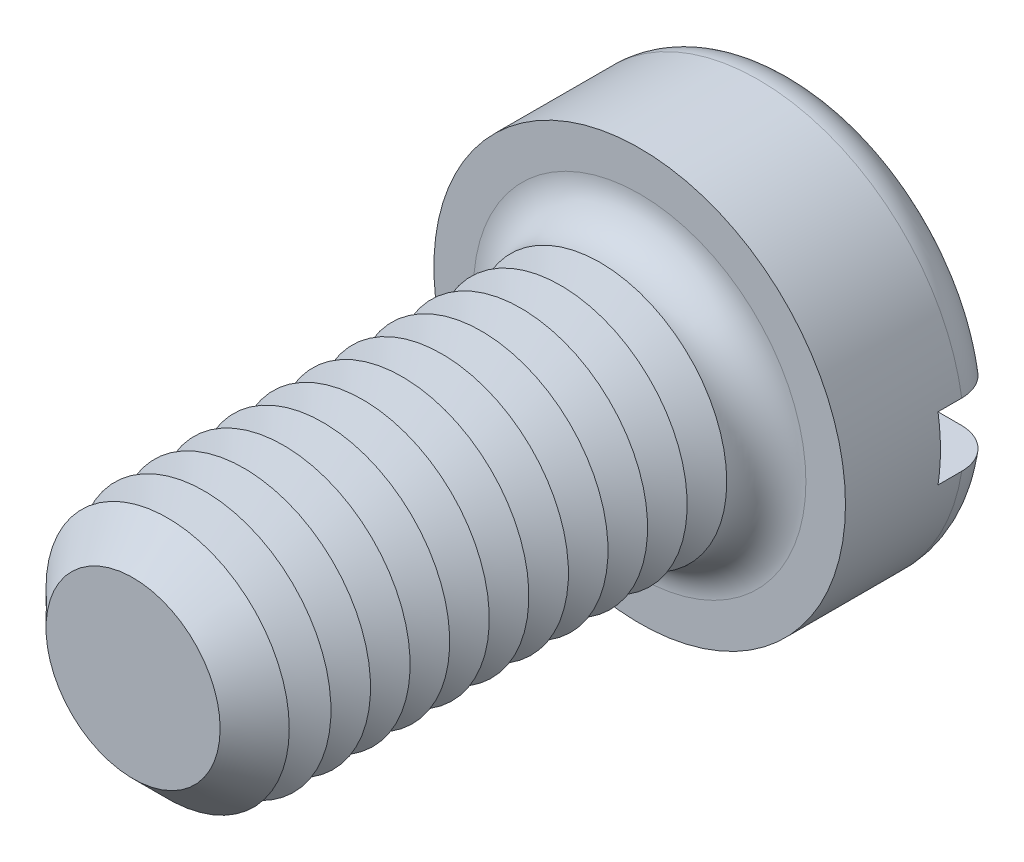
ISO-10303-21;
HEADER;
FILE_DESCRIPTION(('STEP AP214'),'2;1');
FILE_NAME('part.step','',(''),(''),'','','');
FILE_SCHEMA(('AUTOMOTIVE_DESIGN { 1 0 10303 214 1 1 1 1 }'));
ENDSEC;
DATA;
#1=APPLICATION_CONTEXT('core data for automotive mechanical design processes');
#2=APPLICATION_PROTOCOL_DEFINITION('international standard','automotive_design',2000,#1);
#3=PRODUCT_CONTEXT('',#1,'mechanical');
#4=PRODUCT('Part','Part','',(#3));
#5=PRODUCT_RELATED_PRODUCT_CATEGORY('part','',(#4));
#6=PRODUCT_DEFINITION_FORMATION('','',#4);
#7=PRODUCT_DEFINITION_CONTEXT('part definition',#1,'design');
#8=PRODUCT_DEFINITION('design','',#6,#7);
#9=PRODUCT_DEFINITION_SHAPE('','',#8);
#10=(LENGTH_UNIT() NAMED_UNIT(*) SI_UNIT(.MILLI.,.METRE.));
#11=(NAMED_UNIT(*) PLANE_ANGLE_UNIT() SI_UNIT($,.RADIAN.));
#12=(NAMED_UNIT(*) SI_UNIT($,.STERADIAN.) SOLID_ANGLE_UNIT());
#13=UNCERTAINTY_MEASURE_WITH_UNIT(LENGTH_MEASURE(1.E-05),#10,'distance_accuracy_value','');
#14=(GEOMETRIC_REPRESENTATION_CONTEXT(3) GLOBAL_UNCERTAINTY_ASSIGNED_CONTEXT((#13)) GLOBAL_UNIT_ASSIGNED_CONTEXT((#10,
#11,#12)) REPRESENTATION_CONTEXT('',''));
#15=CARTESIAN_POINT('',(0.,0.,0.));
#16=DIRECTION('',(0.,0.,1.));
#17=DIRECTION('',(1.,0.,0.));
#18=AXIS2_PLACEMENT_3D('',#15,#16,#17);
#19=CARTESIAN_POINT('',(0.,0.,-5.));
#20=DIRECTION('',(0.,0.,1.));
#21=DIRECTION('',(1.,0.,0.));
#22=AXIS2_PLACEMENT_3D('',#19,#20,#21);
#23=PLANE('',#22);
#24=CARTESIAN_POINT('',(0.,0.,-5.));
#25=DIRECTION('',(0.,0.,1.));
#26=DIRECTION('',(1.,0.,0.));
#27=AXIS2_PLACEMENT_3D('',#24,#25,#26);
#28=CIRCLE('',#27,5.25);
#29=CARTESIAN_POINT('',(-5.15388203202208,1.,-5.));
#30=VERTEX_POINT('',#29);
#31=CARTESIAN_POINT('',(5.15388203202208,1.,-5.));
#32=VERTEX_POINT('',#31);
#33=EDGE_CURVE('E116',#30,#32,#28,.F.);
#34=ORIENTED_EDGE('',*,*,#33,.T.);
#35=DIRECTION('',(1.,0.,0.));
#36=VECTOR('',#35,1.);
#37=CARTESIAN_POINT('',(-6.5,1.,-5.));
#38=LINE('',#37,#36);
#39=EDGE_CURVE('E111',#30,#32,#38,.T.);
#40=ORIENTED_EDGE('',*,*,#39,.F.);
#41=EDGE_LOOP('',(#34,#40));
#42=FACE_BOUND('',#41,.T.);
#43=ADVANCED_FACE('F39',(#42),#23,.F.);
#44=CARTESIAN_POINT('',(0.,0.,-3.75));
#45=DIRECTION('',(0.,0.,1.));
#46=DIRECTION('',(1.,0.,0.));
#47=AXIS2_PLACEMENT_3D('',#44,#45,#46);
#48=TOROIDAL_SURFACE('',#47,5.25,1.25);
#49=CARTESIAN_POINT('',(-6.04655789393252,1.,-4.63904490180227));
#50=CARTESIAN_POINT('',(-5.99546860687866,1.,-4.68885774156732));
#51=CARTESIAN_POINT('',(-5.94008472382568,1.,-4.73434760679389));
#52=CARTESIAN_POINT('',(-5.8223927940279,1.,-4.81538052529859));
#53=CARTESIAN_POINT('',(-5.7600753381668,1.,-4.85090982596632));
#54=CARTESIAN_POINT('',(-5.63044351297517,1.,-4.91100606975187));
#55=CARTESIAN_POINT('',(-5.56313479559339,1.,-4.93558519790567));
#56=CARTESIAN_POINT('',(-5.42539577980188,1.,-4.97322457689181));
#57=CARTESIAN_POINT('',(-5.35496625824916,1.,-4.98628767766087));
#58=CARTESIAN_POINT('',(-5.21212635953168,1.,-5.00070478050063));
#59=CARTESIAN_POINT('',(-5.13970265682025,1.,-5.00192674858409));
#60=CARTESIAN_POINT('',(-4.99565121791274,1.,-4.99234085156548));
#61=CARTESIAN_POINT('',(-4.92402357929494,1.,-4.98153152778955));
#62=CARTESIAN_POINT('',(-4.78274786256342,1.,-4.94801424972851));
#63=CARTESIAN_POINT('',(-4.71313137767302,1.,-4.92517296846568));
#64=CARTESIAN_POINT('',(-4.57871041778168,1.,-4.86813760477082));
#65=CARTESIAN_POINT('',(-4.51390612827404,1.,-4.83394308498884));
#66=CARTESIAN_POINT('',(-4.39095493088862,1.,-4.75508341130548));
#67=CARTESIAN_POINT('',(-4.33281197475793,1.,-4.7104120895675));
#68=CARTESIAN_POINT('',(-4.22499800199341,1.,-4.61179869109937));
#69=CARTESIAN_POINT('',(-4.17532640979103,1.,-4.55785724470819));
#70=CARTESIAN_POINT('',(-4.08677450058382,1.,-4.4431082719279));
#71=CARTESIAN_POINT('',(-4.0477350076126,1.,-4.38242369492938));
#72=CARTESIAN_POINT('',(-3.98074296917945,1.,-4.25521412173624));
#73=CARTESIAN_POINT('',(-3.95278836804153,1.,-4.18869021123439));
#74=CARTESIAN_POINT('',(-3.90959497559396,1.,-4.0537026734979));
#75=CARTESIAN_POINT('',(-3.89401985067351,1.,-3.98534663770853));
#76=CARTESIAN_POINT('',(-3.8748586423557,1.,-3.84697740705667));
#77=CARTESIAN_POINT('',(-3.87127067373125,1.,-3.7769644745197));
#78=CARTESIAN_POINT('',(-3.8761573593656,1.,-3.63892215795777));
#79=CARTESIAN_POINT('',(-3.88436651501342,1.,-3.57088319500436));
#80=CARTESIAN_POINT('',(-3.91207743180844,1.,-3.43714958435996));
#81=CARTESIAN_POINT('',(-3.93157911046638,1.,-3.37145491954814));
#82=CARTESIAN_POINT('',(-3.98125045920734,1.,-3.24411474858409));
#83=CARTESIAN_POINT('',(-4.01143761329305,1.,-3.18247607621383));
#84=CARTESIAN_POINT('',(-4.08150210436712,1.,-3.064981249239));
#85=CARTESIAN_POINT('',(-4.12138048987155,1.,-3.0091257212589));
#86=CARTESIAN_POINT('',(-4.2106718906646,1.,-2.90336353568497));
#87=CARTESIAN_POINT('',(-4.26028693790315,1.,-2.85362751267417));
#88=CARTESIAN_POINT('',(-4.36696587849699,1.,-2.76291710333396));
#89=CARTESIAN_POINT('',(-4.42403082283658,1.,-2.72194395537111));
#90=CARTESIAN_POINT('',(-4.54567957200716,1.,-2.64877280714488));
#91=CARTESIAN_POINT('',(-4.61042643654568,1.,-2.61684571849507));
#92=CARTESIAN_POINT('',(-4.74430563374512,1.,-2.56412359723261));
#93=CARTESIAN_POINT('',(-4.81343838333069,1.,-2.54332962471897));
#94=CARTESIAN_POINT('',(-4.95527237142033,1.,-2.51320471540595));
#95=CARTESIAN_POINT('',(-5.0280120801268,1.,-2.50405449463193));
#96=CARTESIAN_POINT('',(-5.17399775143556,1.,-2.49810126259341));
#97=CARTESIAN_POINT('',(-5.24724372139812,1.,-2.50129843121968));
#98=CARTESIAN_POINT('',(-5.3921014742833,1.,-2.52000776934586));
#99=CARTESIAN_POINT('',(-5.4637142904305,1.,-2.53551191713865));
#100=CARTESIAN_POINT('',(-5.60326680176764,1.,-2.57846304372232));
#101=CARTESIAN_POINT('',(-5.67120668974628,1.,-2.60590939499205));
#102=CARTESIAN_POINT('',(-5.80064060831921,1.,-2.67164926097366));
#103=CARTESIAN_POINT('',(-5.862199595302,1.,-2.7098148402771));
#104=CARTESIAN_POINT('',(-5.9779079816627,1.,-2.79608690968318));
#105=CARTESIAN_POINT('',(-6.03205795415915,1.,-2.84419263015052));
#106=CARTESIAN_POINT('',(-6.13055119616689,1.,-2.94820522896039));
#107=CARTESIAN_POINT('',(-6.17502887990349,1.,-3.00398483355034));
#108=CARTESIAN_POINT('',(-6.25384180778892,1.,-3.12230113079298));
#109=CARTESIAN_POINT('',(-6.28817779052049,1.,-3.18483733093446));
#110=CARTESIAN_POINT('',(-6.34527986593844,1.,-3.31401726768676));
#111=CARTESIAN_POINT('',(-6.36818984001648,1.,-3.38059742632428));
#112=CARTESIAN_POINT('',(-6.40240470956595,1.,-3.5166725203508));
#113=CARTESIAN_POINT('',(-6.41371067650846,1.,-3.58616718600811));
#114=CARTESIAN_POINT('',(-6.42433240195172,1.,-3.72550026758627));
#115=CARTESIAN_POINT('',(-6.4237441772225,1.,-3.79533138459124));
#116=CARTESIAN_POINT('',(-6.41082814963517,1.,-3.93391789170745));
#117=CARTESIAN_POINT('',(-6.39849757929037,1.,-4.00267302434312));
#118=CARTESIAN_POINT('',(-6.36249191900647,1.,-4.13704597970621));
#119=CARTESIAN_POINT('',(-6.33883072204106,1.,-4.20266753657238));
#120=CARTESIAN_POINT('',(-6.28088769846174,1.,-4.32897165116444));
#121=CARTESIAN_POINT('',(-6.24661890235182,1.,-4.38966015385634));
#122=CARTESIAN_POINT('',(-6.18404039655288,1.,-4.48163773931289));
#123=CARTESIAN_POINT('',(-6.15876600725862,1.,-4.51503333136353));
#124=CARTESIAN_POINT('',(-6.10500607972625,1.,-4.5791298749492));
#125=CARTESIAN_POINT('',(-6.07652056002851,1.,-4.60983084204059));
#126=CARTESIAN_POINT('',(-6.04655789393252,1.,-4.63904490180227));
#127=B_SPLINE_CURVE_WITH_KNOTS('',3,(#49,#50,#51,#52,#53,#54,#55,#56,#57,#58,#59,#60,#61,#62,
#63,#64,#65,#66,#67,#68,#69,#70,#71,#72,#73,#74,#75,#76,#77,#78,#79,#80,#81,#82,#83,#84,#85,#86,
#87,#88,#89,#90,#91,#92,#93,#94,#95,#96,#97,#98,#99,#100,#101,#102,#103,#104,#105,#106,#107,
#108,#109,#110,#111,#112,#113,#114,#115,#116,#117,#118,#119,#120,#121,#122,#123,#124,#125,#126),
.UNSPECIFIED.,.T.,.F.,(4,2,2,2,2,2,2,2,2,2,2,2,2,2,2,2,2,2,2,2,2,2,2,2,2,2,2,2,2,2,2,2,2,2,2,2,
2,2,4),(0.,0.213907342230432,0.428108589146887,0.642070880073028,0.855980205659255,
1.07227200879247,1.28859003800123,1.50735715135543,1.72613269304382,1.94503735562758,
2.16392713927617,2.37933295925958,2.59469881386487,2.80399176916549,3.01325180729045,
3.2178754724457,3.42249764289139,3.62745618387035,3.83243690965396,4.04223444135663,
4.25206160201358,4.46763253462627,4.68322399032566,4.90212226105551,5.12102372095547,
5.33978261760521,5.55853002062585,5.77477015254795,5.99099354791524,6.20398686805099,
6.41696467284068,6.62718821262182,6.83739233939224,7.0459002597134,7.25445733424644,
7.46275934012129,7.67080647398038,7.79625882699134,7.92171045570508),.UNSPECIFIED.);
#128=CARTESIAN_POINT('',(-6.42261628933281,1.,-3.74999999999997));
#129=VERTEX_POINT('',#128);
#130=EDGE_CURVE('E273',#129,#30,#127,.T.);
#131=ORIENTED_EDGE('',*,*,#130,.F.);
#132=CARTESIAN_POINT('',(0.,0.,-3.75));
#133=DIRECTION('',(0.,0.,1.));
#134=DIRECTION('',(1.,0.,0.));
#135=AXIS2_PLACEMENT_3D('',#132,#133,#134);
#136=CIRCLE('',#135,6.5);
#137=CARTESIAN_POINT('',(6.42261628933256,1.,-3.75));
#138=VERTEX_POINT('',#137);
#139=EDGE_CURVE('E125',#138,#129,#136,.T.);
#140=ORIENTED_EDGE('',*,*,#139,.F.);
#141=CARTESIAN_POINT('',(4.06944999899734,1.,-4.4133199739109));
#142=CARTESIAN_POINT('',(4.10828271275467,1.,-4.47354709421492));
#143=CARTESIAN_POINT('',(4.15233880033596,1.,-4.53047894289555));
#144=CARTESIAN_POINT('',(4.24946916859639,1.,-4.63614530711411));
#145=CARTESIAN_POINT('',(4.3025574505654,1.,-4.68486685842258));
#146=CARTESIAN_POINT('',(4.41603250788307,1.,-4.77271114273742));
#147=CARTESIAN_POINT('',(4.47640839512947,1.,-4.8118479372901));
#148=CARTESIAN_POINT('',(4.60277035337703,1.,-4.87959878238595));
#149=CARTESIAN_POINT('',(4.66875480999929,1.,-4.90821584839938));
#150=CARTESIAN_POINT('',(4.80558589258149,1.,-4.95456537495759));
#151=CARTESIAN_POINT('',(4.87649196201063,1.,-4.97212253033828));
#152=CARTESIAN_POINT('',(5.02024710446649,1.,-4.99514979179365));
#153=CARTESIAN_POINT('',(5.09309636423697,1.,-5.00061873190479));
#154=CARTESIAN_POINT('',(5.23902872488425,1.,-4.99926689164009));
#155=CARTESIAN_POINT('',(5.31211131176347,1.,-4.99238812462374));
#156=CARTESIAN_POINT('',(5.45605806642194,1.,-4.96635140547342));
#157=CARTESIAN_POINT('',(5.52692231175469,1.,-4.94719388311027));
#158=CARTESIAN_POINT('',(5.66376170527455,1.,-4.89728421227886));
#159=CARTESIAN_POINT('',(5.72977335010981,1.,-4.86663219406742));
#160=CARTESIAN_POINT('',(5.85560715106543,1.,-4.79452334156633));
#161=CARTESIAN_POINT('',(5.91542977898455,1.,-4.7530673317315));
#162=CARTESIAN_POINT('',(6.02626022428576,1.,-4.66116821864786));
#163=CARTESIAN_POINT('',(6.07738307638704,1.,-4.6108638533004));
#164=CARTESIAN_POINT('',(6.17030947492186,1.,-4.50227823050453));
#165=CARTESIAN_POINT('',(6.2121137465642,1.,-4.44399759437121));
#166=CARTESIAN_POINT('',(6.28460268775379,1.,-4.32200305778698));
#167=CARTESIAN_POINT('',(6.31543589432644,1.,-4.2583773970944));
#168=CARTESIAN_POINT('',(6.36586009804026,1.,-4.12681721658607));
#169=CARTESIAN_POINT('',(6.38545178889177,1.,-4.0588829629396));
#170=CARTESIAN_POINT('',(6.41265760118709,1.,-3.92136007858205));
#171=CARTESIAN_POINT('',(6.42038873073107,1.,-3.85179457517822));
#172=CARTESIAN_POINT('',(6.42401070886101,1.,-3.7123569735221));
#173=CARTESIAN_POINT('',(6.41990193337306,1.,-3.64248488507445));
#174=CARTESIAN_POINT('',(6.40000894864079,1.,-3.50470871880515));
#175=CARTESIAN_POINT('',(6.38427119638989,1.,-3.43679792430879));
#176=CARTESIAN_POINT('',(6.34164491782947,1.,-3.30457296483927));
#177=CARTESIAN_POINT('',(6.31475638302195,1.,-3.24025880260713));
#178=CARTESIAN_POINT('',(6.2505455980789,1.,-3.11686791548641));
#179=CARTESIAN_POINT('',(6.21319759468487,1.,-3.05780459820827));
#180=CARTESIAN_POINT('',(6.12919411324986,1.,-2.94671919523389));
#181=CARTESIAN_POINT('',(6.08253833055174,1.,-2.89469734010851));
#182=CARTESIAN_POINT('',(5.98083387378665,1.,-2.79868150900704));
#183=CARTESIAN_POINT('',(5.92571704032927,1.,-2.75475975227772));
#184=CARTESIAN_POINT('',(5.80897194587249,1.,-2.67665277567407));
#185=CARTESIAN_POINT('',(5.74734329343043,1.,-2.64246814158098));
#186=CARTESIAN_POINT('',(5.6184644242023,1.,-2.58431810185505));
#187=CARTESIAN_POINT('',(5.55115102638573,1.,-2.56049275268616));
#188=CARTESIAN_POINT('',(5.41351272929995,1.,-2.52429868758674));
#189=CARTESIAN_POINT('',(5.34318759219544,1.,-2.51193087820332));
#190=CARTESIAN_POINT('',(5.20041507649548,1.,-2.49882112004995));
#191=CARTESIAN_POINT('',(5.12795169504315,1.,-2.49825332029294));
#192=CARTESIAN_POINT('',(4.98393373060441,1.,-2.50914771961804));
#193=CARTESIAN_POINT('',(4.91237921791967,1.,-2.52061084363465));
#194=CARTESIAN_POINT('',(4.77137358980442,1.,-2.55542281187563));
#195=CARTESIAN_POINT('',(4.70195472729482,1.,-2.57890245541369));
#196=CARTESIAN_POINT('',(4.56803538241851,1.,-2.63717701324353));
#197=CARTESIAN_POINT('',(4.50353509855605,1.,-2.67197238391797));
#198=CARTESIAN_POINT('',(4.38131858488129,1.,-2.7519648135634));
#199=CARTESIAN_POINT('',(4.32360365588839,1.,-2.79716386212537));
#200=CARTESIAN_POINT('',(4.21673400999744,1.,-2.89675634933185));
#201=CARTESIAN_POINT('',(4.16757871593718,1.,-2.95114916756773));
#202=CARTESIAN_POINT('',(4.08014713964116,1.,-3.06667703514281));
#203=CARTESIAN_POINT('',(4.04170608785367,1.,-3.12768727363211));
#204=CARTESIAN_POINT('',(3.97596192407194,1.,-3.25543782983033));
#205=CARTESIAN_POINT('',(3.94865624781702,1.,-3.32217682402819));
#206=CARTESIAN_POINT('',(3.9067737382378,1.,-3.45745603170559));
#207=CARTESIAN_POINT('',(3.89185707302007,1.,-3.52589108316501));
#208=CARTESIAN_POINT('',(3.87400755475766,1.,-3.66432360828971));
#209=CARTESIAN_POINT('',(3.87107601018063,1.,-3.73432125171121));
#210=CARTESIAN_POINT('',(3.8772387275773,1.,-3.87228267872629));
#211=CARTESIAN_POINT('',(3.88607933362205,1.,-3.94025811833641));
#212=CARTESIAN_POINT('',(3.91502769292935,1.,-4.07370133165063));
#213=CARTESIAN_POINT('',(3.93512131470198,1.,-4.1391721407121));
#214=CARTESIAN_POINT('',(3.9752037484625,1.,-4.23926719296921));
#215=CARTESIAN_POINT('',(3.99171171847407,1.,-4.27532618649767));
#216=CARTESIAN_POINT('',(4.02809737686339,1.,-4.34569933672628));
#217=CARTESIAN_POINT('',(4.04797497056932,1.,-4.3800135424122));
#218=CARTESIAN_POINT('',(4.06944999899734,1.,-4.4133199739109));
#219=B_SPLINE_CURVE_WITH_KNOTS('',3,(#141,#142,#143,#144,#145,#146,#147,#148,#149,#150,#151,
#152,#153,#154,#155,#156,#157,#158,#159,#160,#161,#162,#163,#164,#165,#166,#167,#168,#169,#170,
#171,#172,#173,#174,#175,#176,#177,#178,#179,#180,#181,#182,#183,#184,#185,#186,#187,#188,#189,
#190,#191,#192,#193,#194,#195,#196,#197,#198,#199,#200,#201,#202,#203,#204,#205,#206,#207,#208,
#209,#210,#211,#212,#213,#214,#215,#216,#217,#218),.UNSPECIFIED.,.T.,.F.,(4,2,2,2,2,2,2,2,2,2,2,
2,2,2,2,2,2,2,2,2,2,2,2,2,2,2,2,2,2,2,2,2,2,2,2,2,2,2,4),(0.,0.214833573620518,
0.430003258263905,0.644855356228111,0.859645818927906,1.0777603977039,1.29589601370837,
1.51505870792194,1.73421373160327,1.95150241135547,2.16877451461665,2.38290237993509,
2.59701357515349,2.8081044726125,3.01918234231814,3.22816416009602,3.43713934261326,
3.64528416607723,3.85342914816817,4.06209119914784,4.27076008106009,4.48120788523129,
4.69166834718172,4.90489186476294,5.11813225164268,5.33451752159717,5.55091942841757,
5.76972860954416,5.98854661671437,6.20740650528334,6.42625163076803,6.64151774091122,
6.85673425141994,7.0658317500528,7.27495207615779,7.47963858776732,7.68406862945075,
7.80287790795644,7.92168384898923),.UNSPECIFIED.);
#220=EDGE_CURVE('E275',#32,#138,#219,.T.);
#221=ORIENTED_EDGE('',*,*,#220,.F.);
#222=ORIENTED_EDGE('',*,*,#33,.F.);
#223=EDGE_LOOP('',(#131,#140,#221,#222));
#224=FACE_BOUND('',#223,.T.);
#225=ADVANCED_FACE('F257',(#224),#48,.T.);
#226=CARTESIAN_POINT('',(0.,0.,-5.));
#227=DIRECTION('',(0.,0.,1.));
#228=DIRECTION('',(1.,0.,0.));
#229=AXIS2_PLACEMENT_3D('',#226,#227,#228);
#230=CYLINDRICAL_SURFACE('',#229,6.5);
#231=DIRECTION('',(0.,0.,1.));
#232=VECTOR('',#231,1.);
#233=CARTESIAN_POINT('',(6.42261628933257,1.,-5.));
#234=LINE('',#233,#232);
#235=CARTESIAN_POINT('',(6.42261628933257,1.,-3.));
#236=VERTEX_POINT('',#235);
#237=EDGE_CURVE('E290',#138,#236,#234,.T.);
#238=ORIENTED_EDGE('',*,*,#237,.F.);
#239=ORIENTED_EDGE('',*,*,#139,.T.);
#240=DIRECTION('',(0.,0.,1.));
#241=VECTOR('',#240,1.);
#242=CARTESIAN_POINT('',(-6.42261628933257,1.,-5.));
#243=LINE('',#242,#241);
#244=CARTESIAN_POINT('',(-6.42261628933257,1.,-3.));
#245=VERTEX_POINT('',#244);
#246=EDGE_CURVE('E63',#245,#129,#243,.F.);
#247=ORIENTED_EDGE('',*,*,#246,.F.);
#248=CARTESIAN_POINT('',(0.,0.,-3.));
#249=DIRECTION('',(0.,0.,-1.));
#250=DIRECTION('',(-1.,0.,0.));
#251=AXIS2_PLACEMENT_3D('',#248,#249,#250);
#252=CIRCLE('',#251,6.5);
#253=CARTESIAN_POINT('',(-6.42261628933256,-0.999999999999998,-3.));
#254=VERTEX_POINT('',#253);
#255=EDGE_CURVE('E43',#245,#254,#252,.F.);
#256=ORIENTED_EDGE('',*,*,#255,.T.);
#257=DIRECTION('',(0.,0.,1.));
#258=VECTOR('',#257,1.);
#259=CARTESIAN_POINT('',(-6.42261628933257,-0.999999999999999,-5.));
#260=LINE('',#259,#258);
#261=CARTESIAN_POINT('',(-6.42261628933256,-0.999999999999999,-3.75));
#262=VERTEX_POINT('',#261);
#263=EDGE_CURVE('E287',#262,#254,#260,.T.);
#264=ORIENTED_EDGE('',*,*,#263,.F.);
#265=CARTESIAN_POINT('',(6.42261628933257,-1.,-3.75));
#266=VERTEX_POINT('',#265);
#267=EDGE_CURVE('E127',#262,#266,#136,.T.);
#268=ORIENTED_EDGE('',*,*,#267,.T.);
#269=DIRECTION('',(0.,0.,1.));
#270=VECTOR('',#269,1.);
#271=CARTESIAN_POINT('',(6.42261628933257,-1.,-5.));
#272=LINE('',#271,#270);
#273=CARTESIAN_POINT('',(6.42261628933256,-1.,-3.));
#274=VERTEX_POINT('',#273);
#275=EDGE_CURVE('E55',#274,#266,#272,.F.);
#276=ORIENTED_EDGE('',*,*,#275,.F.);
#277=EDGE_CURVE('E11',#274,#236,#252,.F.);
#278=ORIENTED_EDGE('',*,*,#277,.T.);
#279=EDGE_LOOP('',(#238,#239,#247,#256,#264,#268,#276,#278));
#280=FACE_BOUND('',#279,.T.);
#281=CARTESIAN_POINT('',(0.,0.,0.));
#282=DIRECTION('',(0.,0.,1.));
#283=DIRECTION('',(1.,0.,0.));
#284=AXIS2_PLACEMENT_3D('',#281,#282,#283);
#285=CIRCLE('',#284,6.5);
#286=CARTESIAN_POINT('',(6.5,0.,0.));
#287=VERTEX_POINT('',#286);
#288=EDGE_CURVE('E293',#287,#287,#285,.T.);
#289=ORIENTED_EDGE('',*,*,#288,.F.);
#290=EDGE_LOOP('',(#289));
#291=FACE_BOUND('',#290,.T.);
#292=ADVANCED_FACE('F253',(#280,#291),#230,.T.);
#293=CARTESIAN_POINT('',(5.15388203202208,-1.,-5.));
#294=VERTEX_POINT('',#293);
#295=CARTESIAN_POINT('',(-5.15388203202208,-0.999999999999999,-5.));
#296=VERTEX_POINT('',#295);
#297=EDGE_CURVE('E109',#294,#296,#28,.F.);
#298=ORIENTED_EDGE('',*,*,#297,.T.);
#299=DIRECTION('',(-1.,0.,0.));
#300=VECTOR('',#299,1.);
#301=CARTESIAN_POINT('',(-6.5,-0.999999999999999,-5.));
#302=LINE('',#301,#300);
#303=EDGE_CURVE('E96',#294,#296,#302,.T.);
#304=ORIENTED_EDGE('',*,*,#303,.F.);
#305=EDGE_LOOP('',(#298,#304));
#306=FACE_BOUND('',#305,.T.);
#307=ADVANCED_FACE('F108',(#306),#23,.F.);
#308=CARTESIAN_POINT('',(0.,0.,0.));
#309=DIRECTION('',(0.,0.,1.));
#310=DIRECTION('',(1.,0.,0.));
#311=AXIS2_PLACEMENT_3D('',#308,#309,#310);
#312=PLANE('',#311);
#313=CARTESIAN_POINT('',(0.,0.,0.));
#314=DIRECTION('',(0.,0.,1.));
#315=DIRECTION('',(1.,0.,0.));
#316=AXIS2_PLACEMENT_3D('',#313,#314,#315);
#317=CIRCLE('',#316,5.25);
#318=CARTESIAN_POINT('',(5.25,0.,0.));
#319=VERTEX_POINT('',#318);
#320=EDGE_CURVE('E115',#319,#319,#317,.F.);
#321=ORIENTED_EDGE('',*,*,#320,.T.);
#322=EDGE_LOOP('',(#321));
#323=FACE_BOUND('',#322,.T.);
#324=ORIENTED_EDGE('',*,*,#288,.T.);
#325=EDGE_LOOP('',(#324));
#326=FACE_BOUND('',#325,.T.);
#327=ADVANCED_FACE('F252',(#323,#326),#312,.T.);
#328=CARTESIAN_POINT('',(-6.04655789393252,-0.999999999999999,-4.63904490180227));
#329=CARTESIAN_POINT('',(-6.0966604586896,-0.999999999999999,-4.59018532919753));
#330=CARTESIAN_POINT('',(-6.14270501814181,-0.999999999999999,-4.53709744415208));
#331=CARTESIAN_POINT('',(-6.22528519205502,-0.999999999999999,-4.42391631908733));
#332=CARTESIAN_POINT('',(-6.26181074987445,-0.999999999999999,-4.36381576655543));
#333=CARTESIAN_POINT('',(-6.32422109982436,-0.999999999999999,-4.23831836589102));
#334=CARTESIAN_POINT('',(-6.35010658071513,-0.999999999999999,-4.17292186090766));
#335=CARTESIAN_POINT('',(-6.39044668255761,-0.999999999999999,-4.03870925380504));
#336=CARTESIAN_POINT('',(-6.40490396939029,-0.999999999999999,-3.96989395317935));
#337=CARTESIAN_POINT('',(-6.42190814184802,-0.999999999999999,-3.83122595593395));
#338=CARTESIAN_POINT('',(-6.4245257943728,-0.999999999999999,-3.76138193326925));
#339=CARTESIAN_POINT('',(-6.41796432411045,-0.999999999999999,-3.62224935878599));
#340=CARTESIAN_POINT('',(-6.40878509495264,-0.999999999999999,-3.55296081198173));
#341=CARTESIAN_POINT('',(-6.37894560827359,-0.999999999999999,-3.41709241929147));
#342=CARTESIAN_POINT('',(-6.35831520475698,-0.999999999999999,-3.35050601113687));
#343=CARTESIAN_POINT('',(-6.30620980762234,-0.999999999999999,-3.22172312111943));
#344=CARTESIAN_POINT('',(-6.2747347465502,-0.999999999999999,-3.15952666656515));
#345=CARTESIAN_POINT('',(-6.20172710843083,-0.999999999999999,-3.04101762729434));
#346=CARTESIAN_POINT('',(-6.16015622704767,-0.999999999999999,-2.98472864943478));
#347=CARTESIAN_POINT('',(-6.06823774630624,-0.999999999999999,-2.87984578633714));
#348=CARTESIAN_POINT('',(-6.01788981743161,-0.999999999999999,-2.83125219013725));
#349=CARTESIAN_POINT('',(-5.90933830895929,-0.999999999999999,-2.74262118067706));
#350=CARTESIAN_POINT('',(-5.85106338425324,-0.999999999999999,-2.70267117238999));
#351=CARTESIAN_POINT('',(-5.72870702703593,-0.999999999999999,-2.63296796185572));
#352=CARTESIAN_POINT('',(-5.66462521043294,-0.999999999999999,-2.6032154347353));
#353=CARTESIAN_POINT('',(-5.53153273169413,-0.999999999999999,-2.55430842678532));
#354=CARTESIAN_POINT('',(-5.46246626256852,-0.999999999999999,-2.53530583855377));
#355=CARTESIAN_POINT('',(-5.32214267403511,-0.999999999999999,-2.5089831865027));
#356=CARTESIAN_POINT('',(-5.25088537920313,-0.999999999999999,-2.50166406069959));
#357=CARTESIAN_POINT('',(-5.10710123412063,-0.999999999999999,-2.49882202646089));
#358=CARTESIAN_POINT('',(-5.03457095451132,-0.999999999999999,-2.50347166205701));
#359=CARTESIAN_POINT('',(-4.8912897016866,-0.999999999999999,-2.52476029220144));
#360=CARTESIAN_POINT('',(-4.82053886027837,-0.999999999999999,-2.54140017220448));
#361=CARTESIAN_POINT('',(-4.68213257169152,-0.999999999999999,-2.58641614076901));
#362=CARTESIAN_POINT('',(-4.61451256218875,-0.999999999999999,-2.61490131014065));
#363=CARTESIAN_POINT('',(-4.48502801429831,-0.999999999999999,-2.68285095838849));
#364=CARTESIAN_POINT('',(-4.42316359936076,-0.999999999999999,-2.72231567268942));
#365=CARTESIAN_POINT('',(-4.30720694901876,-0.999999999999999,-2.81103994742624));
#366=CARTESIAN_POINT('',(-4.25309118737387,-0.999999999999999,-2.86026872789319));
#367=CARTESIAN_POINT('',(-4.15409408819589,-0.999999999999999,-2.9672764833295));
#368=CARTESIAN_POINT('',(-4.10921182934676,-0.999999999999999,-3.02505460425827));
#369=CARTESIAN_POINT('',(-4.03096584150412,-0.999999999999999,-3.14632492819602));
#370=CARTESIAN_POINT('',(-3.99739097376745,-0.999999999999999,-3.2096807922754));
#371=CARTESIAN_POINT('',(-3.94171839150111,-0.999999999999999,-3.34124912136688));
#372=CARTESIAN_POINT('',(-3.91961840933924,-0.999999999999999,-3.40946062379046));
#373=CARTESIAN_POINT('',(-3.88816636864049,-0.999999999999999,-3.54669256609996));
#374=CARTESIAN_POINT('',(-3.87846562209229,-0.999999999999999,-3.61563318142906));
#375=CARTESIAN_POINT('',(-3.87100568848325,-0.999999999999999,-3.75415397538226));
#376=CARTESIAN_POINT('',(-3.87324501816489,-0.999999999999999,-3.82373407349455));
#377=CARTESIAN_POINT('',(-3.88943589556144,-0.999999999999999,-3.96027701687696));
#378=CARTESIAN_POINT('',(-3.90318225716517,-0.999999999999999,-4.0272643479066));
#379=CARTESIAN_POINT('',(-3.94163954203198,-0.999999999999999,-4.1580093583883));
#380=CARTESIAN_POINT('',(-3.96635075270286,-0.999999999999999,-4.22176695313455));
#381=CARTESIAN_POINT('',(-4.026160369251,-0.999999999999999,-4.34483320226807));
#382=CARTESIAN_POINT('',(-4.06134035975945,-0.999999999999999,-4.40410214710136));
#383=CARTESIAN_POINT('',(-4.14090865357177,-0.999999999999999,-4.51609417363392));
#384=CARTESIAN_POINT('',(-4.18529811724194,-0.999999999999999,-4.56881642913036));
#385=CARTESIAN_POINT('',(-4.2832649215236,-0.999999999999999,-4.66770177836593));
#386=CARTESIAN_POINT('',(-4.33705327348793,-0.999999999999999,-4.71365579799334));
#387=CARTESIAN_POINT('',(-4.45141776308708,-0.999999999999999,-4.79615385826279));
#388=CARTESIAN_POINT('',(-4.51199483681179,-0.999999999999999,-4.83269659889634));
#389=CARTESIAN_POINT('',(-4.63989216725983,-0.999999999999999,-4.89626962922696));
#390=CARTESIAN_POINT('',(-4.70734508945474,-0.999999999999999,-4.92303326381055));
#391=CARTESIAN_POINT('',(-4.84575497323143,-0.999999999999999,-4.96500199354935));
#392=CARTESIAN_POINT('',(-4.91671207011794,-0.999999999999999,-4.98020664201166));
#393=CARTESIAN_POINT('',(-5.06097761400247,-0.999999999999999,-4.9987306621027));
#394=CARTESIAN_POINT('',(-5.13430353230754,-0.999999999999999,-5.00191441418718));
#395=CARTESIAN_POINT('',(-5.28046546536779,-0.999999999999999,-4.99587686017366));
#396=CARTESIAN_POINT('',(-5.35330135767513,-0.999999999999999,-4.98665256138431));
#397=CARTESIAN_POINT('',(-5.49610354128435,-0.999999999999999,-4.95604184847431));
#398=CARTESIAN_POINT('',(-5.56607890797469,-0.999999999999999,-4.93469772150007));
#399=CARTESIAN_POINT('',(-5.70131538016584,-0.999999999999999,-4.88041956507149));
#400=CARTESIAN_POINT('',(-5.76658233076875,-0.999999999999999,-4.84750021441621));
#401=CARTESIAN_POINT('',(-5.86782577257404,-0.999999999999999,-4.78498748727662));
#402=CARTESIAN_POINT('',(-5.90579749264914,-0.999999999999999,-4.75856648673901));
#403=CARTESIAN_POINT('',(-5.97862186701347,-0.999999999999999,-4.70172646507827));
#404=CARTESIAN_POINT('',(-6.0134745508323,-0.999999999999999,-4.6713074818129));
#405=CARTESIAN_POINT('',(-6.04655789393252,-0.999999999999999,-4.63904490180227));
#406=B_SPLINE_CURVE_WITH_KNOTS('',3,(#328,#329,#330,#331,#332,#333,#334,#335,#336,#337,#338,
#339,#340,#341,#342,#343,#344,#345,#346,#347,#348,#349,#350,#351,#352,#353,#354,#355,#356,#357,
#358,#359,#360,#361,#362,#363,#364,#365,#366,#367,#368,#369,#370,#371,#372,#373,#374,#375,#376,
#377,#378,#379,#380,#381,#382,#383,#384,#385,#386,#387,#388,#389,#390,#391,#392,#393,#394,#395,
#396,#397,#398,#399,#400,#401,#402,#403,#404,#405),.UNSPECIFIED.,.T.,.F.,(4,2,2,2,2,2,2,2,2,2,2,
2,2,2,2,2,2,2,2,2,2,2,2,2,2,2,2,2,2,2,2,2,2,2,2,2,2,2,4),(0.,0.209780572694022,
0.419781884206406,0.629769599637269,0.839708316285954,1.04839053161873,1.2570746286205,
1.46521720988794,1.67336108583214,1.88230736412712,2.09126148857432,2.30223890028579,
2.51323027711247,2.72713284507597,2.94105258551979,3.15807345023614,3.37511034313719,
3.59419176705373,3.81327788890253,4.03168404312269,4.25006839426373,4.46411376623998,
4.67811682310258,4.88595885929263,5.09377507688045,5.29796268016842,5.50215563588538,
5.70798353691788,5.91383738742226,6.12510741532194,6.33640661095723,6.55309998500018,
6.76980173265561,6.98894112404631,7.20813337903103,7.42656551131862,7.64472163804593,
7.78324365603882,7.92176436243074),.UNSPECIFIED.);
#407=EDGE_CURVE('E103',#296,#262,#406,.T.);
#408=ORIENTED_EDGE('',*,*,#407,.F.);
#409=ORIENTED_EDGE('',*,*,#297,.F.);
#410=CARTESIAN_POINT('',(4.06944999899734,-1.,-4.4133199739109));
#411=CARTESIAN_POINT('',(4.03213207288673,-1.,-4.3554312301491));
#412=CARTESIAN_POINT('',(3.9995849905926,-1.,-4.29441722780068));
#413=CARTESIAN_POINT('',(3.94511822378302,-1.,-4.16776604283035));
#414=CARTESIAN_POINT('',(3.92320762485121,-1.,-4.10212496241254));
#415=CARTESIAN_POINT('',(3.89078811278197,-1.,-3.96804412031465));
#416=CARTESIAN_POINT('',(3.88028409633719,-1.,-3.89960316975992));
#417=CARTESIAN_POINT('',(3.87107895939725,-1.,-3.76194650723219));
#418=CARTESIAN_POINT('',(3.87237511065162,-1.,-3.69273097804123));
#419=CARTESIAN_POINT('',(3.88662927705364,-1.,-3.55634460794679));
#420=CARTESIAN_POINT('',(3.89944923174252,-1.,-3.48915926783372));
#421=CARTESIAN_POINT('',(3.93611188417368,-1.,-3.35786953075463));
#422=CARTESIAN_POINT('',(3.95995518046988,-1.,-3.29376530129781));
#423=CARTESIAN_POINT('',(4.0180748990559,-1.,-3.16993562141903));
#424=CARTESIAN_POINT('',(4.05242297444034,-1.,-3.11024385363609));
#425=CARTESIAN_POINT('',(4.13041121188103,-1.,-2.9972793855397));
#426=CARTESIAN_POINT('',(4.17405248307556,-1.,-2.94400745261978));
#427=CARTESIAN_POINT('',(4.27058636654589,-1.,-2.8439150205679));
#428=CARTESIAN_POINT('',(4.32368948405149,-1.,-2.79729757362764));
#429=CARTESIAN_POINT('',(4.43679856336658,-1.,-2.71336600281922));
#430=CARTESIAN_POINT('',(4.49680546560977,-1.,-2.67605314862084));
#431=CARTESIAN_POINT('',(4.62370121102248,-1.,-2.61081752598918));
#432=CARTESIAN_POINT('',(4.69072799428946,-1.,-2.58316284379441));
#433=CARTESIAN_POINT('',(4.82843981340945,-1.,-2.5393441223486));
#434=CARTESIAN_POINT('',(4.899125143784,-1.,-2.52318100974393));
#435=CARTESIAN_POINT('',(5.04306377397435,-1.,-2.50267755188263));
#436=CARTESIAN_POINT('',(5.11633773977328,-1.,-2.49848181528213));
#437=CARTESIAN_POINT('',(5.26254809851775,-1.,-2.50249357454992));
#438=CARTESIAN_POINT('',(5.33548449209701,-1.,-2.51070104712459));
#439=CARTESIAN_POINT('',(5.4786703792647,-1.,-2.53930888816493));
#440=CARTESIAN_POINT('',(5.54892819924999,-1.,-2.5596675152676));
#441=CARTESIAN_POINT('',(5.68495799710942,-1.,-2.61204238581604));
#442=CARTESIAN_POINT('',(5.75073024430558,-1.,-2.64405792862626));
#443=CARTESIAN_POINT('',(5.8750178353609,-1.,-2.7184150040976));
#444=CARTESIAN_POINT('',(5.93361487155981,-1.,-2.76061995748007));
#445=CARTESIAN_POINT('',(6.04275377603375,-1.,-2.85440601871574));
#446=CARTESIAN_POINT('',(6.09329629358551,-1.,-2.90598637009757));
#447=CARTESIAN_POINT('',(6.18409572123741,-1.,-3.01622977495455));
#448=CARTESIAN_POINT('',(6.2244945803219,-1.,-3.07477592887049));
#449=CARTESIAN_POINT('',(6.29474798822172,-1.,-3.19788594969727));
#450=CARTESIAN_POINT('',(6.3246032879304,-1.,-3.26244938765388));
#451=CARTESIAN_POINT('',(6.37256001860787,-1.,-3.39491634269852));
#452=CARTESIAN_POINT('',(6.39079949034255,-1.,-3.46276990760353));
#453=CARTESIAN_POINT('',(6.41554133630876,-1.,-3.60058363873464));
#454=CARTESIAN_POINT('',(6.42204424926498,-1.,-3.67054370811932));
#455=CARTESIAN_POINT('',(6.42311237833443,-1.,-3.81007982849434));
#456=CARTESIAN_POINT('',(6.41775799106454,-1.,-3.879655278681));
#457=CARTESIAN_POINT('',(6.39543799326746,-1.,-4.01691664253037));
#458=CARTESIAN_POINT('',(6.3784725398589,-1.,-4.08460258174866));
#459=CARTESIAN_POINT('',(6.33344768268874,-1.,-4.21614537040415));
#460=CARTESIAN_POINT('',(6.30539273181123,-1.,-4.28000374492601));
#461=CARTESIAN_POINT('',(6.23902076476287,-1.,-4.40214140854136));
#462=CARTESIAN_POINT('',(6.20070356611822,-1.,-4.46042059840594));
#463=CARTESIAN_POINT('',(6.11467174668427,-1.,-4.5701315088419));
#464=CARTESIAN_POINT('',(6.06690270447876,-1.,-4.62152053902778));
#465=CARTESIAN_POINT('',(5.96350111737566,-1.,-4.715657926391));
#466=CARTESIAN_POINT('',(5.90786817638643,-1.,-4.75840584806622));
#467=CARTESIAN_POINT('',(5.78965380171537,-1.,-4.8345781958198));
#468=CARTESIAN_POINT('',(5.72700078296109,-1.,-4.86789149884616));
#469=CARTESIAN_POINT('',(5.59704977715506,-1.,-4.92369754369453));
#470=CARTESIAN_POINT('',(5.52975144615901,-1.,-4.94618948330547));
#471=CARTESIAN_POINT('',(5.39137621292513,-1.,-4.98006173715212));
#472=CARTESIAN_POINT('',(5.32025859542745,-1.,-4.99127571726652));
#473=CARTESIAN_POINT('',(5.17715081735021,-1.,-5.00177798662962));
#474=CARTESIAN_POINT('',(5.10516061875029,-1.,-5.00106575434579));
#475=CARTESIAN_POINT('',(4.96131924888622,-1.,-4.98769775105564));
#476=CARTESIAN_POINT('',(4.88948297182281,-1.,-4.97488146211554));
#477=CARTESIAN_POINT('',(4.74893184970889,-1.,-4.93744335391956));
#478=CARTESIAN_POINT('',(4.68021795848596,-1.,-4.91281795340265));
#479=CARTESIAN_POINT('',(4.54744428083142,-1.,-4.8522329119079));
#480=CARTESIAN_POINT('',(4.48341761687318,-1.,-4.81620070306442));
#481=CARTESIAN_POINT('',(4.36244497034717,-1.,-4.73383277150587));
#482=CARTESIAN_POINT('',(4.30549069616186,-1.,-4.68750929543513));
#483=CARTESIAN_POINT('',(4.21823158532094,-1.,-4.60311228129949));
#484=CARTESIAN_POINT('',(4.18544074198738,-1.,-4.56757118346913));
#485=CARTESIAN_POINT('',(4.12413461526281,-1.,-4.49297229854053));
#486=CARTESIAN_POINT('',(4.09561926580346,-1.,-4.45391456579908));
#487=CARTESIAN_POINT('',(4.06944999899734,-1.,-4.4133199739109));
#488=B_SPLINE_CURVE_WITH_KNOTS('',3,(#410,#411,#412,#413,#414,#415,#416,#417,#418,#419,#420,
#421,#422,#423,#424,#425,#426,#427,#428,#429,#430,#431,#432,#433,#434,#435,#436,#437,#438,#439,
#440,#441,#442,#443,#444,#445,#446,#447,#448,#449,#450,#451,#452,#453,#454,#455,#456,#457,#458,
#459,#460,#461,#462,#463,#464,#465,#466,#467,#468,#469,#470,#471,#472,#473,#474,#475,#476,#477,
#478,#479,#480,#481,#482,#483,#484,#485,#486,#487),.UNSPECIFIED.,.T.,.F.,(4,2,2,2,2,2,2,2,2,2,2,
2,2,2,2,2,2,2,2,2,2,2,2,2,2,2,2,2,2,2,2,2,2,2,2,2,2,2,4),(0.,0.206453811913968,0.4130836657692,
0.619802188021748,0.826472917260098,1.03070015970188,1.23493849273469,1.44060223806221,
1.64629054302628,1.85731119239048,2.06836062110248,2.28487349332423,2.5014038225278,
2.72053974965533,2.9396752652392,3.15806230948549,3.37643622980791,3.59203140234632,
3.80760918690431,4.01997696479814,4.23232961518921,4.44210913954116,4.65187903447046,
4.86023097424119,5.06858009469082,5.27684563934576,5.48511488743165,5.69462015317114,
5.90413597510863,6.11602561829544,6.32793096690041,6.54291770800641,6.75791385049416,
6.97580180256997,7.19375587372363,7.41312537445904,7.63223520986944,7.77701357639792,
7.92178970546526),.UNSPECIFIED.);
#489=EDGE_CURVE('E92',#266,#294,#488,.T.);
#490=ORIENTED_EDGE('',*,*,#489,.F.);
#491=ORIENTED_EDGE('',*,*,#267,.F.);
#492=EDGE_LOOP('',(#408,#409,#490,#491));
#493=FACE_BOUND('',#492,.T.);
#494=ADVANCED_FACE('F113',(#493),#48,.T.);
#495=CARTESIAN_POINT('',(0.,0.,1.25));
#496=DIRECTION('',(0.,0.,1.));
#497=DIRECTION('',(1.,0.,0.));
#498=AXIS2_PLACEMENT_3D('',#495,#496,#497);
#499=TOROIDAL_SURFACE('',#498,5.25,1.25);
#500=ORIENTED_EDGE('',*,*,#320,.F.);
#501=EDGE_LOOP('',(#500));
#502=FACE_BOUND('',#501,.T.);
#503=CARTESIAN_POINT('',(0.,0.,1.25));
#504=DIRECTION('',(0.,0.,-1.));
#505=DIRECTION('',(-1.,0.,0.));
#506=AXIS2_PLACEMENT_3D('',#503,#504,#505);
#507=CIRCLE('',#506,4.);
#508=CARTESIAN_POINT('',(-4.,0.,1.25));
#509=VERTEX_POINT('',#508);
#510=EDGE_CURVE('E297',#509,#509,#507,.T.);
#511=ORIENTED_EDGE('',*,*,#510,.T.);
#512=EDGE_LOOP('',(#511));
#513=FACE_BOUND('',#512,.T.);
#514=ADVANCED_FACE('F245',(#502,#513),#499,.F.);
#515=CARTESIAN_POINT('',(0.,0.,1.875));
#516=DIRECTION('',(0.,0.,-1.));
#517=DIRECTION('',(-1.,0.,0.));
#518=AXIS2_PLACEMENT_3D('',#515,#516,#517);
#519=CONICAL_SURFACE('',#518,2.91746824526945,1.0471975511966);
#520=ORIENTED_EDGE('',*,*,#510,.F.);
#521=EDGE_LOOP('',(#520));
#522=FACE_BOUND('',#521,.T.);
#523=CARTESIAN_POINT('',(0.,0.,1.875));
#524=DIRECTION('',(0.,0.,-1.));
#525=DIRECTION('',(-1.,0.,0.));
#526=AXIS2_PLACEMENT_3D('',#523,#524,#525);
#527=CIRCLE('',#526,2.91746824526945);
#528=CARTESIAN_POINT('',(-2.91746824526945,0.,1.875));
#529=VERTEX_POINT('',#528);
#530=EDGE_CURVE('E303',#529,#529,#527,.T.);
#531=ORIENTED_EDGE('',*,*,#530,.T.);
#532=EDGE_LOOP('',(#531));
#533=FACE_BOUND('',#532,.T.);
#534=ADVANCED_FACE('F241',(#522,#533),#519,.T.);
#535=CARTESIAN_POINT('',(0.,0.,2.5));
#536=DIRECTION('',(0.,0.,1.));
#537=DIRECTION('',(1.,0.,0.));
#538=AXIS2_PLACEMENT_3D('',#535,#536,#537);
#539=CONICAL_SURFACE('',#538,4.,1.0471975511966);
#540=ORIENTED_EDGE('',*,*,#530,.F.);
#541=EDGE_LOOP('',(#540));
#542=FACE_BOUND('',#541,.T.);
#543=CARTESIAN_POINT('',(0.,0.,2.5));
#544=DIRECTION('',(0.,0.,-1.));
#545=DIRECTION('',(-1.,0.,0.));
#546=AXIS2_PLACEMENT_3D('',#543,#544,#545);
#547=CIRCLE('',#546,4.);
#548=CARTESIAN_POINT('',(-4.,0.,2.5));
#549=VERTEX_POINT('',#548);
#550=EDGE_CURVE('E309',#549,#549,#547,.T.);
#551=ORIENTED_EDGE('',*,*,#550,.T.);
#552=EDGE_LOOP('',(#551));
#553=FACE_BOUND('',#552,.T.);
#554=ADVANCED_FACE('F237',(#542,#553),#539,.T.);
#555=CARTESIAN_POINT('',(0.,0.,3.125));
#556=DIRECTION('',(0.,0.,-1.));
#557=DIRECTION('',(-1.,0.,0.));
#558=AXIS2_PLACEMENT_3D('',#555,#556,#557);
#559=CONICAL_SURFACE('',#558,2.91746824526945,1.0471975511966);
#560=ORIENTED_EDGE('',*,*,#550,.F.);
#561=EDGE_LOOP('',(#560));
#562=FACE_BOUND('',#561,.T.);
#563=CARTESIAN_POINT('',(0.,0.,3.125));
#564=DIRECTION('',(0.,0.,-1.));
#565=DIRECTION('',(-1.,0.,0.));
#566=AXIS2_PLACEMENT_3D('',#563,#564,#565);
#567=CIRCLE('',#566,2.91746824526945);
#568=CARTESIAN_POINT('',(-2.91746824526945,0.,3.125));
#569=VERTEX_POINT('',#568);
#570=EDGE_CURVE('E313',#569,#569,#567,.T.);
#571=ORIENTED_EDGE('',*,*,#570,.T.);
#572=EDGE_LOOP('',(#571));
#573=FACE_BOUND('',#572,.T.);
#574=ADVANCED_FACE('F233',(#562,#573),#559,.T.);
#575=CARTESIAN_POINT('',(0.,0.,3.75));
#576=DIRECTION('',(0.,0.,1.));
#577=DIRECTION('',(1.,0.,0.));
#578=AXIS2_PLACEMENT_3D('',#575,#576,#577);
#579=CONICAL_SURFACE('',#578,4.,1.0471975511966);
#580=ORIENTED_EDGE('',*,*,#570,.F.);
#581=EDGE_LOOP('',(#580));
#582=FACE_BOUND('',#581,.T.);
#583=CARTESIAN_POINT('',(0.,0.,3.75));
#584=DIRECTION('',(0.,0.,-1.));
#585=DIRECTION('',(-1.,0.,0.));
#586=AXIS2_PLACEMENT_3D('',#583,#584,#585);
#587=CIRCLE('',#586,4.);
#588=CARTESIAN_POINT('',(-4.,0.,3.75));
#589=VERTEX_POINT('',#588);
#590=EDGE_CURVE('E317',#589,#589,#587,.T.);
#591=ORIENTED_EDGE('',*,*,#590,.T.);
#592=EDGE_LOOP('',(#591));
#593=FACE_BOUND('',#592,.T.);
#594=ADVANCED_FACE('F229',(#582,#593),#579,.T.);
#595=CARTESIAN_POINT('',(0.,0.,4.375));
#596=DIRECTION('',(0.,0.,-1.));
#597=DIRECTION('',(-1.,0.,0.));
#598=AXIS2_PLACEMENT_3D('',#595,#596,#597);
#599=CONICAL_SURFACE('',#598,2.91746824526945,1.0471975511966);
#600=ORIENTED_EDGE('',*,*,#590,.F.);
#601=EDGE_LOOP('',(#600));
#602=FACE_BOUND('',#601,.T.);
#603=CARTESIAN_POINT('',(0.,0.,4.375));
#604=DIRECTION('',(0.,0.,-1.));
#605=DIRECTION('',(-1.,0.,0.));
#606=AXIS2_PLACEMENT_3D('',#603,#604,#605);
#607=CIRCLE('',#606,2.91746824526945);
#608=CARTESIAN_POINT('',(-2.91746824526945,0.,4.375));
#609=VERTEX_POINT('',#608);
#610=EDGE_CURVE('E321',#609,#609,#607,.T.);
#611=ORIENTED_EDGE('',*,*,#610,.T.);
#612=EDGE_LOOP('',(#611));
#613=FACE_BOUND('',#612,.T.);
#614=ADVANCED_FACE('F225',(#602,#613),#599,.T.);
#615=CARTESIAN_POINT('',(0.,0.,5.));
#616=DIRECTION('',(0.,0.,1.));
#617=DIRECTION('',(1.,0.,0.));
#618=AXIS2_PLACEMENT_3D('',#615,#616,#617);
#619=CONICAL_SURFACE('',#618,4.,1.0471975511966);
#620=ORIENTED_EDGE('',*,*,#610,.F.);
#621=EDGE_LOOP('',(#620));
#622=FACE_BOUND('',#621,.T.);
#623=CARTESIAN_POINT('',(0.,0.,5.));
#624=DIRECTION('',(0.,0.,-1.));
#625=DIRECTION('',(-1.,0.,0.));
#626=AXIS2_PLACEMENT_3D('',#623,#624,#625);
#627=CIRCLE('',#626,4.);
#628=CARTESIAN_POINT('',(-4.,0.,5.));
#629=VERTEX_POINT('',#628);
#630=EDGE_CURVE('E325',#629,#629,#627,.T.);
#631=ORIENTED_EDGE('',*,*,#630,.T.);
#632=EDGE_LOOP('',(#631));
#633=FACE_BOUND('',#632,.T.);
#634=ADVANCED_FACE('F221',(#622,#633),#619,.T.);
#635=CARTESIAN_POINT('',(0.,0.,5.625));
#636=DIRECTION('',(0.,0.,-1.));
#637=DIRECTION('',(-1.,0.,0.));
#638=AXIS2_PLACEMENT_3D('',#635,#636,#637);
#639=CONICAL_SURFACE('',#638,2.91746824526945,1.0471975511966);
#640=ORIENTED_EDGE('',*,*,#630,.F.);
#641=EDGE_LOOP('',(#640));
#642=FACE_BOUND('',#641,.T.);
#643=CARTESIAN_POINT('',(0.,0.,5.625));
#644=DIRECTION('',(0.,0.,-1.));
#645=DIRECTION('',(-1.,0.,0.));
#646=AXIS2_PLACEMENT_3D('',#643,#644,#645);
#647=CIRCLE('',#646,2.91746824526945);
#648=CARTESIAN_POINT('',(-2.91746824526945,0.,5.625));
#649=VERTEX_POINT('',#648);
#650=EDGE_CURVE('E328',#649,#649,#647,.T.);
#651=ORIENTED_EDGE('',*,*,#650,.T.);
#652=EDGE_LOOP('',(#651));
#653=FACE_BOUND('',#652,.T.);
#654=ADVANCED_FACE('F217',(#642,#653),#639,.T.);
#655=CARTESIAN_POINT('',(0.,0.,6.25));
#656=DIRECTION('',(0.,0.,1.));
#657=DIRECTION('',(1.,0.,0.));
#658=AXIS2_PLACEMENT_3D('',#655,#656,#657);
#659=CONICAL_SURFACE('',#658,4.,1.0471975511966);
#660=ORIENTED_EDGE('',*,*,#650,.F.);
#661=EDGE_LOOP('',(#660));
#662=FACE_BOUND('',#661,.T.);
#663=CARTESIAN_POINT('',(0.,0.,6.25));
#664=DIRECTION('',(0.,0.,-1.));
#665=DIRECTION('',(-1.,0.,0.));
#666=AXIS2_PLACEMENT_3D('',#663,#664,#665);
#667=CIRCLE('',#666,4.);
#668=CARTESIAN_POINT('',(-4.,0.,6.25));
#669=VERTEX_POINT('',#668);
#670=EDGE_CURVE('E332',#669,#669,#667,.T.);
#671=ORIENTED_EDGE('',*,*,#670,.T.);
#672=EDGE_LOOP('',(#671));
#673=FACE_BOUND('',#672,.T.);
#674=ADVANCED_FACE('F213',(#662,#673),#659,.T.);
#675=CARTESIAN_POINT('',(0.,0.,6.875));
#676=DIRECTION('',(0.,0.,-1.));
#677=DIRECTION('',(-1.,0.,0.));
#678=AXIS2_PLACEMENT_3D('',#675,#676,#677);
#679=CONICAL_SURFACE('',#678,2.91746824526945,1.0471975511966);
#680=ORIENTED_EDGE('',*,*,#670,.F.);
#681=EDGE_LOOP('',(#680));
#682=FACE_BOUND('',#681,.T.);
#683=CARTESIAN_POINT('',(0.,0.,6.875));
#684=DIRECTION('',(0.,0.,-1.));
#685=DIRECTION('',(-1.,0.,0.));
#686=AXIS2_PLACEMENT_3D('',#683,#684,#685);
#687=CIRCLE('',#686,2.91746824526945);
#688=CARTESIAN_POINT('',(-2.91746824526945,0.,6.875));
#689=VERTEX_POINT('',#688);
#690=EDGE_CURVE('E335',#689,#689,#687,.T.);
#691=ORIENTED_EDGE('',*,*,#690,.T.);
#692=EDGE_LOOP('',(#691));
#693=FACE_BOUND('',#692,.T.);
#694=ADVANCED_FACE('F209',(#682,#693),#679,.T.);
#695=CARTESIAN_POINT('',(0.,0.,7.5));
#696=DIRECTION('',(0.,0.,1.));
#697=DIRECTION('',(1.,0.,0.));
#698=AXIS2_PLACEMENT_3D('',#695,#696,#697);
#699=CONICAL_SURFACE('',#698,4.,1.0471975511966);
#700=ORIENTED_EDGE('',*,*,#690,.F.);
#701=EDGE_LOOP('',(#700));
#702=FACE_BOUND('',#701,.T.);
#703=CARTESIAN_POINT('',(0.,0.,7.5));
#704=DIRECTION('',(0.,0.,-1.));
#705=DIRECTION('',(-1.,0.,0.));
#706=AXIS2_PLACEMENT_3D('',#703,#704,#705);
#707=CIRCLE('',#706,4.);
#708=CARTESIAN_POINT('',(-4.,0.,7.5));
#709=VERTEX_POINT('',#708);
#710=EDGE_CURVE('E339',#709,#709,#707,.T.);
#711=ORIENTED_EDGE('',*,*,#710,.T.);
#712=EDGE_LOOP('',(#711));
#713=FACE_BOUND('',#712,.T.);
#714=ADVANCED_FACE('F205',(#702,#713),#699,.T.);
#715=CARTESIAN_POINT('',(0.,0.,8.125));
#716=DIRECTION('',(0.,0.,-1.));
#717=DIRECTION('',(-1.,0.,0.));
#718=AXIS2_PLACEMENT_3D('',#715,#716,#717);
#719=CONICAL_SURFACE('',#718,2.91746824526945,1.0471975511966);
#720=ORIENTED_EDGE('',*,*,#710,.F.);
#721=EDGE_LOOP('',(#720));
#722=FACE_BOUND('',#721,.T.);
#723=CARTESIAN_POINT('',(0.,0.,8.125));
#724=DIRECTION('',(0.,0.,-1.));
#725=DIRECTION('',(-1.,0.,0.));
#726=AXIS2_PLACEMENT_3D('',#723,#724,#725);
#727=CIRCLE('',#726,2.91746824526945);
#728=CARTESIAN_POINT('',(-2.91746824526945,0.,8.125));
#729=VERTEX_POINT('',#728);
#730=EDGE_CURVE('E342',#729,#729,#727,.T.);
#731=ORIENTED_EDGE('',*,*,#730,.T.);
#732=EDGE_LOOP('',(#731));
#733=FACE_BOUND('',#732,.T.);
#734=ADVANCED_FACE('F201',(#722,#733),#719,.T.);
#735=CARTESIAN_POINT('',(0.,0.,8.75));
#736=DIRECTION('',(0.,0.,1.));
#737=DIRECTION('',(1.,0.,0.));
#738=AXIS2_PLACEMENT_3D('',#735,#736,#737);
#739=CONICAL_SURFACE('',#738,4.,1.0471975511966);
#740=ORIENTED_EDGE('',*,*,#730,.F.);
#741=EDGE_LOOP('',(#740));
#742=FACE_BOUND('',#741,.T.);
#743=CARTESIAN_POINT('',(0.,0.,8.75));
#744=DIRECTION('',(0.,0.,-1.));
#745=DIRECTION('',(-1.,0.,0.));
#746=AXIS2_PLACEMENT_3D('',#743,#744,#745);
#747=CIRCLE('',#746,4.);
#748=CARTESIAN_POINT('',(-4.,0.,8.75));
#749=VERTEX_POINT('',#748);
#750=EDGE_CURVE('E346',#749,#749,#747,.T.);
#751=ORIENTED_EDGE('',*,*,#750,.T.);
#752=EDGE_LOOP('',(#751));
#753=FACE_BOUND('',#752,.T.);
#754=ADVANCED_FACE('F197',(#742,#753),#739,.T.);
#755=CARTESIAN_POINT('',(0.,0.,9.375));
#756=DIRECTION('',(0.,0.,-1.));
#757=DIRECTION('',(-1.,0.,0.));
#758=AXIS2_PLACEMENT_3D('',#755,#756,#757);
#759=CONICAL_SURFACE('',#758,2.91746824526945,1.0471975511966);
#760=ORIENTED_EDGE('',*,*,#750,.F.);
#761=EDGE_LOOP('',(#760));
#762=FACE_BOUND('',#761,.T.);
#763=CARTESIAN_POINT('',(0.,0.,9.375));
#764=DIRECTION('',(0.,0.,-1.));
#765=DIRECTION('',(-1.,0.,0.));
#766=AXIS2_PLACEMENT_3D('',#763,#764,#765);
#767=CIRCLE('',#766,2.91746824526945);
#768=CARTESIAN_POINT('',(-2.91746824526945,0.,9.375));
#769=VERTEX_POINT('',#768);
#770=EDGE_CURVE('E350',#769,#769,#767,.T.);
#771=ORIENTED_EDGE('',*,*,#770,.T.);
#772=EDGE_LOOP('',(#771));
#773=FACE_BOUND('',#772,.T.);
#774=ADVANCED_FACE('F193',(#762,#773),#759,.T.);
#775=CARTESIAN_POINT('',(0.,0.,10.));
#776=DIRECTION('',(0.,0.,1.));
#777=DIRECTION('',(1.,0.,0.));
#778=AXIS2_PLACEMENT_3D('',#775,#776,#777);
#779=CONICAL_SURFACE('',#778,4.,1.0471975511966);
#780=ORIENTED_EDGE('',*,*,#770,.F.);
#781=EDGE_LOOP('',(#780));
#782=FACE_BOUND('',#781,.T.);
#783=CARTESIAN_POINT('',(0.,0.,10.));
#784=DIRECTION('',(0.,0.,-1.));
#785=DIRECTION('',(-1.,0.,0.));
#786=AXIS2_PLACEMENT_3D('',#783,#784,#785);
#787=CIRCLE('',#786,4.);
#788=CARTESIAN_POINT('',(-4.,0.,10.));
#789=VERTEX_POINT('',#788);
#790=EDGE_CURVE('E353',#789,#789,#787,.T.);
#791=ORIENTED_EDGE('',*,*,#790,.T.);
#792=EDGE_LOOP('',(#791));
#793=FACE_BOUND('',#792,.T.);
#794=ADVANCED_FACE('F189',(#782,#793),#779,.T.);
#795=CARTESIAN_POINT('',(0.,0.,10.625));
#796=DIRECTION('',(0.,0.,-1.));
#797=DIRECTION('',(-1.,0.,0.));
#798=AXIS2_PLACEMENT_3D('',#795,#796,#797);
#799=CONICAL_SURFACE('',#798,2.91746824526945,1.0471975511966);
#800=ORIENTED_EDGE('',*,*,#790,.F.);
#801=EDGE_LOOP('',(#800));
#802=FACE_BOUND('',#801,.T.);
#803=CARTESIAN_POINT('',(0.,0.,10.625));
#804=DIRECTION('',(0.,0.,-1.));
#805=DIRECTION('',(-1.,0.,0.));
#806=AXIS2_PLACEMENT_3D('',#803,#804,#805);
#807=CIRCLE('',#806,2.91746824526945);
#808=CARTESIAN_POINT('',(-2.91746824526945,0.,10.625));
#809=VERTEX_POINT('',#808);
#810=EDGE_CURVE('E356',#809,#809,#807,.T.);
#811=ORIENTED_EDGE('',*,*,#810,.T.);
#812=EDGE_LOOP('',(#811));
#813=FACE_BOUND('',#812,.T.);
#814=ADVANCED_FACE('F185',(#802,#813),#799,.T.);
#815=CARTESIAN_POINT('',(0.,0.,11.25));
#816=DIRECTION('',(0.,0.,1.));
#817=DIRECTION('',(1.,0.,0.));
#818=AXIS2_PLACEMENT_3D('',#815,#816,#817);
#819=CONICAL_SURFACE('',#818,4.,1.0471975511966);
#820=ORIENTED_EDGE('',*,*,#810,.F.);
#821=EDGE_LOOP('',(#820));
#822=FACE_BOUND('',#821,.T.);
#823=CARTESIAN_POINT('',(0.,0.,11.25));
#824=DIRECTION('',(0.,0.,-1.));
#825=DIRECTION('',(-1.,0.,0.));
#826=AXIS2_PLACEMENT_3D('',#823,#824,#825);
#827=CIRCLE('',#826,4.);
#828=CARTESIAN_POINT('',(-4.,0.,11.25));
#829=VERTEX_POINT('',#828);
#830=EDGE_CURVE('E360',#829,#829,#827,.T.);
#831=ORIENTED_EDGE('',*,*,#830,.T.);
#832=EDGE_LOOP('',(#831));
#833=FACE_BOUND('',#832,.T.);
#834=ADVANCED_FACE('F181',(#822,#833),#819,.T.);
#835=CARTESIAN_POINT('',(0.,0.,11.875));
#836=DIRECTION('',(0.,0.,-1.));
#837=DIRECTION('',(-1.,0.,0.));
#838=AXIS2_PLACEMENT_3D('',#835,#836,#837);
#839=CONICAL_SURFACE('',#838,2.91746824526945,1.0471975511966);
#840=ORIENTED_EDGE('',*,*,#830,.F.);
#841=EDGE_LOOP('',(#840));
#842=FACE_BOUND('',#841,.T.);
#843=CARTESIAN_POINT('',(0.,0.,11.875));
#844=DIRECTION('',(0.,0.,-1.));
#845=DIRECTION('',(-1.,0.,0.));
#846=AXIS2_PLACEMENT_3D('',#843,#844,#845);
#847=CIRCLE('',#846,2.91746824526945);
#848=CARTESIAN_POINT('',(-2.91746824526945,0.,11.875));
#849=VERTEX_POINT('',#848);
#850=EDGE_CURVE('E364',#849,#849,#847,.T.);
#851=ORIENTED_EDGE('',*,*,#850,.T.);
#852=EDGE_LOOP('',(#851));
#853=FACE_BOUND('',#852,.T.);
#854=ADVANCED_FACE('F177',(#842,#853),#839,.T.);
#855=CARTESIAN_POINT('',(0.,0.,12.5));
#856=DIRECTION('',(0.,0.,1.));
#857=DIRECTION('',(1.,0.,0.));
#858=AXIS2_PLACEMENT_3D('',#855,#856,#857);
#859=CONICAL_SURFACE('',#858,4.,1.0471975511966);
#860=ORIENTED_EDGE('',*,*,#850,.F.);
#861=EDGE_LOOP('',(#860));
#862=FACE_BOUND('',#861,.T.);
#863=CARTESIAN_POINT('',(0.,0.,12.5));
#864=DIRECTION('',(0.,0.,-1.));
#865=DIRECTION('',(-1.,0.,0.));
#866=AXIS2_PLACEMENT_3D('',#863,#864,#865);
#867=CIRCLE('',#866,4.);
#868=CARTESIAN_POINT('',(-4.,0.,12.5));
#869=VERTEX_POINT('',#868);
#870=EDGE_CURVE('E368',#869,#869,#867,.T.);
#871=ORIENTED_EDGE('',*,*,#870,.T.);
#872=EDGE_LOOP('',(#871));
#873=FACE_BOUND('',#872,.T.);
#874=ADVANCED_FACE('F173',(#862,#873),#859,.T.);
#875=CARTESIAN_POINT('',(0.,0.,13.125));
#876=DIRECTION('',(0.,0.,-1.));
#877=DIRECTION('',(-1.,0.,0.));
#878=AXIS2_PLACEMENT_3D('',#875,#876,#877);
#879=CONICAL_SURFACE('',#878,2.91746824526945,1.0471975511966);
#880=ORIENTED_EDGE('',*,*,#870,.F.);
#881=EDGE_LOOP('',(#880));
#882=FACE_BOUND('',#881,.T.);
#883=CARTESIAN_POINT('',(0.,0.,13.125));
#884=DIRECTION('',(0.,0.,-1.));
#885=DIRECTION('',(-1.,0.,0.));
#886=AXIS2_PLACEMENT_3D('',#883,#884,#885);
#887=CIRCLE('',#886,2.91746824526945);
#888=CARTESIAN_POINT('',(-2.91746824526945,0.,13.125));
#889=VERTEX_POINT('',#888);
#890=EDGE_CURVE('E136',#889,#889,#887,.T.);
#891=ORIENTED_EDGE('',*,*,#890,.T.);
#892=EDGE_LOOP('',(#891));
#893=FACE_BOUND('',#892,.T.);
#894=ADVANCED_FACE('F169',(#882,#893),#879,.T.);
#895=CARTESIAN_POINT('',(0.,0.,13.75));
#896=DIRECTION('',(0.,0.,1.));
#897=DIRECTION('',(1.,0.,0.));
#898=AXIS2_PLACEMENT_3D('',#895,#896,#897);
#899=CONICAL_SURFACE('',#898,4.,1.0471975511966);
#900=ORIENTED_EDGE('',*,*,#890,.F.);
#901=EDGE_LOOP('',(#900));
#902=FACE_BOUND('',#901,.T.);
#903=CARTESIAN_POINT('',(0.,0.,13.75));
#904=DIRECTION('',(0.,0.,-1.));
#905=DIRECTION('',(-1.,0.,0.));
#906=AXIS2_PLACEMENT_3D('',#903,#904,#905);
#907=CIRCLE('',#906,4.);
#908=CARTESIAN_POINT('',(-4.,0.,13.75));
#909=VERTEX_POINT('',#908);
#910=EDGE_CURVE('E137',#909,#909,#907,.T.);
#911=ORIENTED_EDGE('',*,*,#910,.T.);
#912=EDGE_LOOP('',(#911));
#913=FACE_BOUND('',#912,.T.);
#914=ADVANCED_FACE('F165',(#902,#913),#899,.T.);
#915=CARTESIAN_POINT('',(0.,0.,14.375));
#916=DIRECTION('',(0.,0.,-1.));
#917=DIRECTION('',(-1.,0.,0.));
#918=AXIS2_PLACEMENT_3D('',#915,#916,#917);
#919=CONICAL_SURFACE('',#918,2.91746824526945,1.0471975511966);
#920=ORIENTED_EDGE('',*,*,#910,.F.);
#921=EDGE_LOOP('',(#920));
#922=FACE_BOUND('',#921,.T.);
#923=CARTESIAN_POINT('',(0.,0.,14.375));
#924=DIRECTION('',(0.,0.,-1.));
#925=DIRECTION('',(-1.,0.,0.));
#926=AXIS2_PLACEMENT_3D('',#923,#924,#925);
#927=CIRCLE('',#926,2.91746824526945);
#928=CARTESIAN_POINT('',(-2.91746824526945,0.,14.375));
#929=VERTEX_POINT('',#928);
#930=EDGE_CURVE('E378',#929,#929,#927,.T.);
#931=ORIENTED_EDGE('',*,*,#930,.T.);
#932=EDGE_LOOP('',(#931));
#933=FACE_BOUND('',#932,.T.);
#934=ADVANCED_FACE('F161',(#922,#933),#919,.T.);
#935=CARTESIAN_POINT('',(0.,0.,15.));
#936=DIRECTION('',(0.,0.,1.));
#937=DIRECTION('',(1.,0.,0.));
#938=AXIS2_PLACEMENT_3D('',#935,#936,#937);
#939=CONICAL_SURFACE('',#938,4.,1.0471975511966);
#940=CARTESIAN_POINT('',(0.,0.,14.9084936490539));
#941=DIRECTION('',(0.,0.,1.));
#942=DIRECTION('',(1.,0.,0.));
#943=AXIS2_PLACEMENT_3D('',#940,#941,#942);
#944=CIRCLE('',#943,3.8415063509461);
#945=CARTESIAN_POINT('',(3.8415063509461,0.,14.9084936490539));
#946=VERTEX_POINT('',#945);
#947=EDGE_CURVE('E133',#946,#946,#944,.F.);
#948=ORIENTED_EDGE('',*,*,#947,.T.);
#949=EDGE_LOOP('',(#948));
#950=FACE_BOUND('',#949,.T.);
#951=ORIENTED_EDGE('',*,*,#930,.F.);
#952=EDGE_LOOP('',(#951));
#953=FACE_BOUND('',#952,.T.);
#954=ADVANCED_FACE('F156',(#950,#953),#939,.T.);
#955=CARTESIAN_POINT('',(0.,0.,16.));
#956=DIRECTION('',(0.,0.,1.));
#957=DIRECTION('',(1.,0.,0.));
#958=AXIS2_PLACEMENT_3D('',#955,#956,#957);
#959=PLANE('',#958);
#960=CARTESIAN_POINT('',(0.,0.,16.));
#961=DIRECTION('',(0.,0.,1.));
#962=DIRECTION('',(1.,0.,0.));
#963=AXIS2_PLACEMENT_3D('',#960,#961,#962);
#964=CIRCLE('',#963,2.75);
#965=CARTESIAN_POINT('',(2.75,0.,16.));
#966=VERTEX_POINT('',#965);
#967=EDGE_CURVE('E104',#966,#966,#964,.T.);
#968=ORIENTED_EDGE('',*,*,#967,.T.);
#969=EDGE_LOOP('',(#968));
#970=FACE_BOUND('',#969,.T.);
#971=ADVANCED_FACE('F160',(#970),#959,.T.);
#972=CARTESIAN_POINT('',(0.,0.,16.));
#973=DIRECTION('',(0.,0.,-1.));
#974=DIRECTION('',(-1.,0.,0.));
#975=AXIS2_PLACEMENT_3D('',#972,#973,#974);
#976=CONICAL_SURFACE('',#975,2.75,0.785398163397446);
#977=ORIENTED_EDGE('',*,*,#947,.F.);
#978=EDGE_LOOP('',(#977));
#979=FACE_BOUND('',#978,.T.);
#980=ORIENTED_EDGE('',*,*,#967,.F.);
#981=EDGE_LOOP('',(#980));
#982=FACE_BOUND('',#981,.T.);
#983=ADVANCED_FACE('F41',(#979,#982),#976,.T.);
#984=CARTESIAN_POINT('',(-6.5,1.,-3.));
#985=DIRECTION('',(0.,1.,0.));
#986=DIRECTION('',(-1.,0.,0.));
#987=AXIS2_PLACEMENT_3D('',#984,#985,#986);
#988=PLANE('',#987);
#989=ORIENTED_EDGE('',*,*,#246,.T.);
#990=ORIENTED_EDGE('',*,*,#130,.T.);
#991=ORIENTED_EDGE('',*,*,#39,.T.);
#992=ORIENTED_EDGE('',*,*,#220,.T.);
#993=ORIENTED_EDGE('',*,*,#237,.T.);
#994=DIRECTION('',(1.,0.,0.));
#995=VECTOR('',#994,1.);
#996=CARTESIAN_POINT('',(-6.5,1.,-3.));
#997=LINE('',#996,#995);
#998=EDGE_CURVE('E388',#245,#236,#997,.T.);
#999=ORIENTED_EDGE('',*,*,#998,.F.);
#1000=EDGE_LOOP('',(#989,#990,#991,#992,#993,#999));
#1001=FACE_BOUND('',#1000,.T.);
#1002=ADVANCED_FACE('F153',(#1001),#988,.F.);
#1003=CARTESIAN_POINT('',(-6.5,-0.999999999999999,-3.));
#1004=DIRECTION('',(0.,-1.,0.));
#1005=DIRECTION('',(1.,0.,0.));
#1006=AXIS2_PLACEMENT_3D('',#1003,#1004,#1005);
#1007=PLANE('',#1006);
#1008=ORIENTED_EDGE('',*,*,#263,.T.);
#1009=DIRECTION('',(-1.,0.,0.));
#1010=VECTOR('',#1009,1.);
#1011=CARTESIAN_POINT('',(-6.5,-0.999999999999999,-3.));
#1012=LINE('',#1011,#1010);
#1013=EDGE_CURVE('E390',#274,#254,#1012,.T.);
#1014=ORIENTED_EDGE('',*,*,#1013,.F.);
#1015=ORIENTED_EDGE('',*,*,#275,.T.);
#1016=ORIENTED_EDGE('',*,*,#489,.T.);
#1017=ORIENTED_EDGE('',*,*,#303,.T.);
#1018=ORIENTED_EDGE('',*,*,#407,.T.);
#1019=EDGE_LOOP('',(#1008,#1014,#1015,#1016,#1017,#1018));
#1020=FACE_BOUND('',#1019,.T.);
#1021=ADVANCED_FACE('F95',(#1020),#1007,.F.);
#1022=CARTESIAN_POINT('',(0.,0.,-3.));
#1023=DIRECTION('',(0.,0.,-1.));
#1024=DIRECTION('',(-1.,0.,0.));
#1025=AXIS2_PLACEMENT_3D('',#1022,#1023,#1024);
#1026=PLANE('',#1025);
#1027=ORIENTED_EDGE('',*,*,#1013,.T.);
#1028=ORIENTED_EDGE('',*,*,#255,.F.);
#1029=ORIENTED_EDGE('',*,*,#998,.T.);
#1030=ORIENTED_EDGE('',*,*,#277,.F.);
#1031=EDGE_LOOP('',(#1027,#1028,#1029,#1030));
#1032=FACE_BOUND('',#1031,.T.);
#1033=ADVANCED_FACE('F152',(#1032),#1026,.T.);
#1034=CLOSED_SHELL('',(#43,#225,#292,#307,#327,#494,#514,#534,#554,#574,#594,#614,#634,#654,
#674,#694,#714,#734,#754,#774,#794,#814,#834,#854,#874,#894,#914,#934,#954,#971,#983,#1002,
#1021,#1033));
#1035=MANIFOLD_SOLID_BREP('B2',#1034);
#1036=ADVANCED_BREP_SHAPE_REPRESENTATION('',(#18,#1035),#14);
#1037=SHAPE_DEFINITION_REPRESENTATION(#9,#1036);
ENDSEC;
END-ISO-10303-21;
